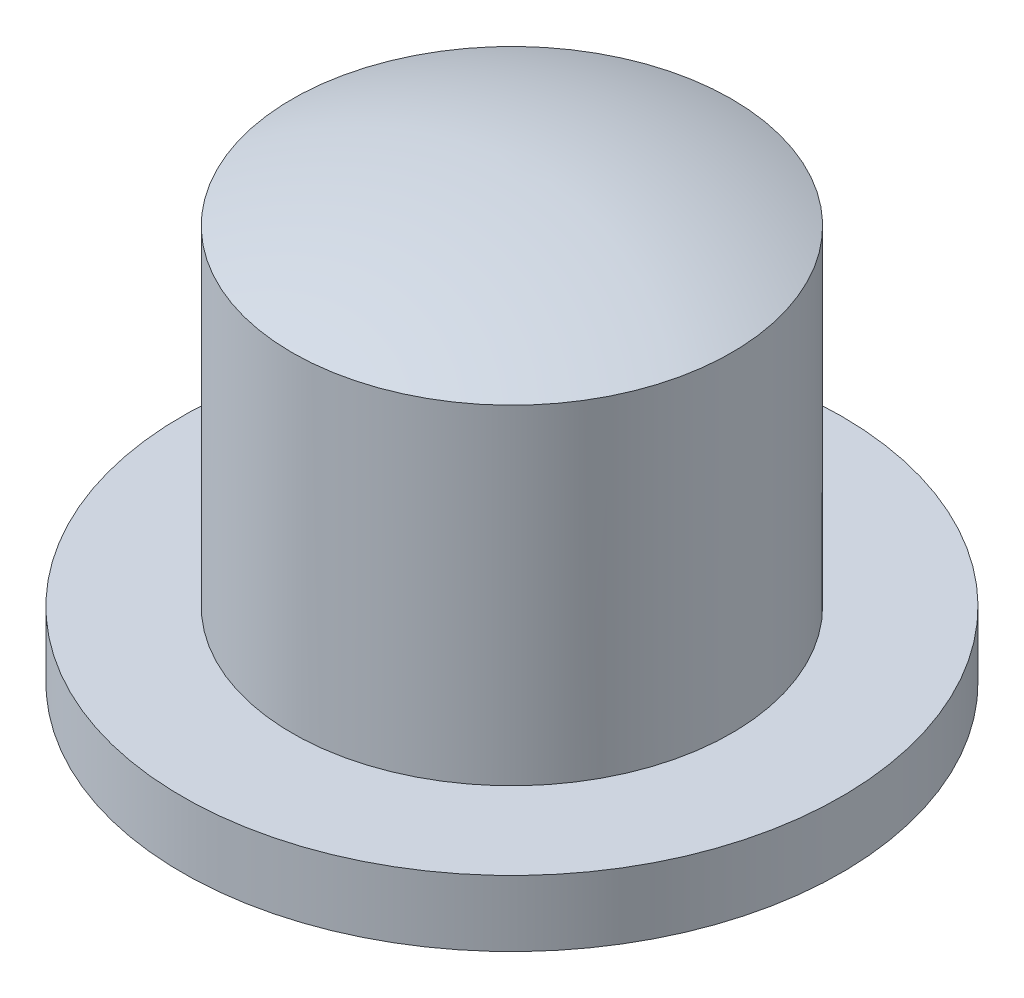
from build123d import *

# Parameters (mm, degrees)
SKETCH1_R           = 3.81
BOSS_EXTRUDE1_DEPTH = 0.762
SKETCH2_R           = 2.54
BOSS_EXTRUDE2_DEPTH = 3.81
DOME1_FACE_RADIUS   = 2.54
DOME1_HEIGHT        = 0.508


with BuildPart() as part:
    # Sketch1 → Boss-Extrude1 (new body)
    with BuildSketch(Plane(origin=(0, 0, 0), x_dir=(1, 0, 0), z_dir=(0, 1, 0))):
        with Locations(Location((0, 0, 0), (0, 0, 90))):
            Circle(SKETCH1_R)
    extrude(amount=BOSS_EXTRUDE1_DEPTH)

    # Sketch2 → Boss-Extrude2 (add)
    with BuildSketch(Plane(origin=(0, 0.762, 0), x_dir=(1, 0, 0), z_dir=(0, 1, 0))):
        with Locations(Location((0, 0, 0), (0, 0, 90))):
            Circle(SKETCH2_R)
    extrude(amount=BOSS_EXTRUDE2_DEPTH)

    # Dome1: a dome of height H over a round flat face of radius A is a cap of a sphere of radius (A * A + H * H) / (2 * H)
    dome1_r = (DOME1_FACE_RADIUS * DOME1_FACE_RADIUS + DOME1_HEIGHT * DOME1_HEIGHT) / (2 * DOME1_HEIGHT)
    dome1_base = Plane((0, 4.572, 0), z_dir=(0, 1, 0))
    with Locations(dome1_base.offset(DOME1_HEIGHT - dome1_r)):
        dome1_ball = Sphere(dome1_r, mode=Mode.PRIVATE)
    add(split(dome1_ball, bisect_by=dome1_base, keep=Keep.TOP, mode=Mode.PRIVATE))


solid = part.part
